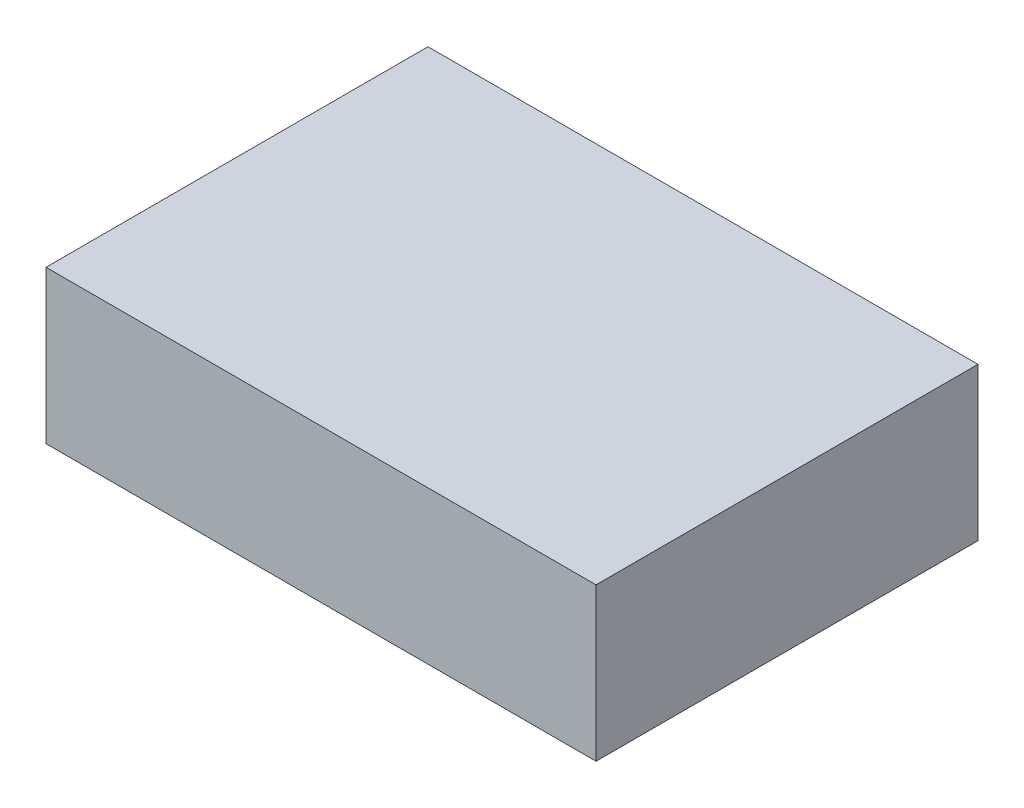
from build123d import *

# Parameters (mm, degrees)
SKETCH1_W           = 36
SKETCH1_H           = 25
BOSS_EXTRUDE1_DEPTH = 10


with BuildPart() as part:
    # Sketch1 → Boss-Extrude1 (new body)
    with BuildSketch(Plane(origin=(0, 0, 0), x_dir=(1, 0, 0), z_dir=(0, 1, 0))):
        Rectangle(SKETCH1_W, SKETCH1_H)
    extrude(amount=BOSS_EXTRUDE1_DEPTH)


solid = part.part
